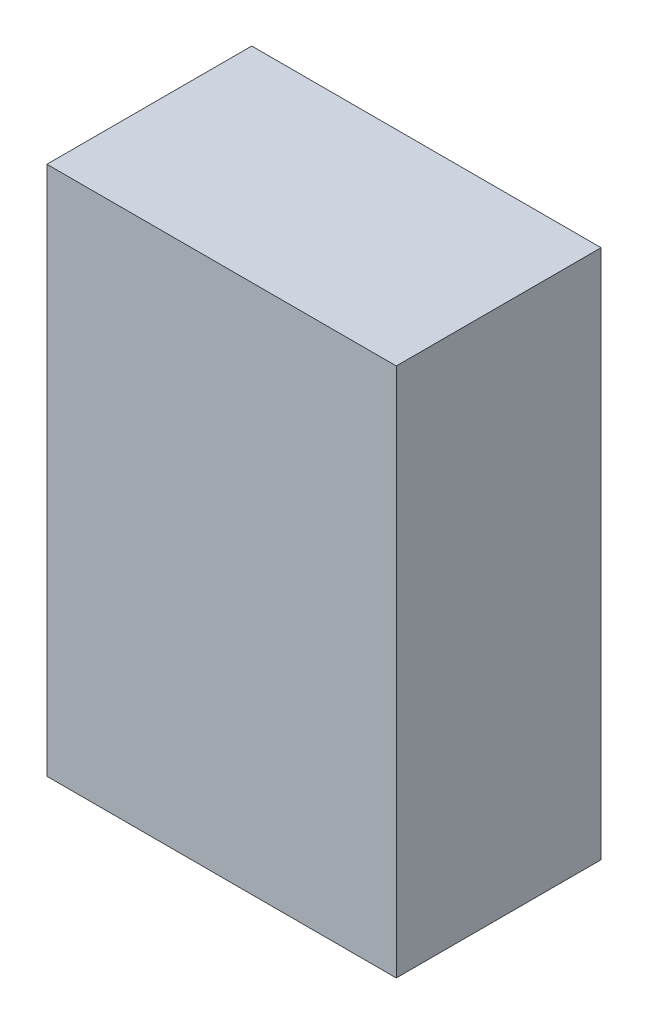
from build123d import *

# Parameters (mm, degrees)
SKETCH1_W           = 58
SKETCH1_H           = 88
BOSS_EXTRUDE1_DEPTH = 34


with BuildPart() as part:
    # Sketch1 → Boss-Extrude1 (new body)
    with BuildSketch(Plane.XY):
        with Locations((29, 44)):
            Rectangle(SKETCH1_W, SKETCH1_H)
    extrude(amount=BOSS_EXTRUDE1_DEPTH)


solid = part.part
